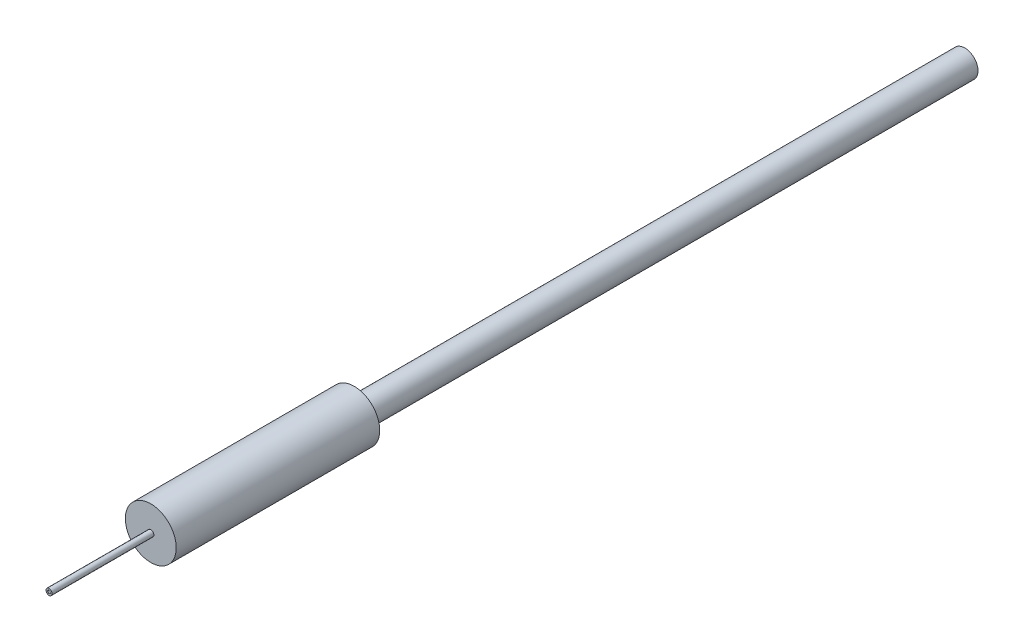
ISO-10303-21;
HEADER;
FILE_DESCRIPTION(('STEP AP214'),'2;1');
FILE_NAME('part.step','',(''),(''),'','','');
FILE_SCHEMA(('AUTOMOTIVE_DESIGN { 1 0 10303 214 1 1 1 1 }'));
ENDSEC;
DATA;
#1=APPLICATION_CONTEXT('core data for automotive mechanical design processes');
#2=APPLICATION_PROTOCOL_DEFINITION('international standard','automotive_design',2000,#1);
#3=PRODUCT_CONTEXT('',#1,'mechanical');
#4=PRODUCT('Part','Part','',(#3));
#5=PRODUCT_RELATED_PRODUCT_CATEGORY('part','',(#4));
#6=PRODUCT_DEFINITION_FORMATION('','',#4);
#7=PRODUCT_DEFINITION_CONTEXT('part definition',#1,'design');
#8=PRODUCT_DEFINITION('design','',#6,#7);
#9=PRODUCT_DEFINITION_SHAPE('','',#8);
#10=(LENGTH_UNIT() NAMED_UNIT(*) SI_UNIT(.MILLI.,.METRE.));
#11=(NAMED_UNIT(*) PLANE_ANGLE_UNIT() SI_UNIT($,.RADIAN.));
#12=(NAMED_UNIT(*) SI_UNIT($,.STERADIAN.) SOLID_ANGLE_UNIT());
#13=UNCERTAINTY_MEASURE_WITH_UNIT(LENGTH_MEASURE(1.E-05),#10,'distance_accuracy_value','');
#14=(GEOMETRIC_REPRESENTATION_CONTEXT(3) GLOBAL_UNCERTAINTY_ASSIGNED_CONTEXT((#13)) GLOBAL_UNIT_ASSIGNED_CONTEXT((#10,
#11,#12)) REPRESENTATION_CONTEXT('',''));
#15=CARTESIAN_POINT('',(0.,0.,0.));
#16=DIRECTION('',(0.,0.,1.));
#17=DIRECTION('',(1.,0.,0.));
#18=AXIS2_PLACEMENT_3D('',#15,#16,#17);
#19=CARTESIAN_POINT('',(0.,0.,-10.));
#20=DIRECTION('',(0.,0.,1.));
#21=DIRECTION('',(1.,0.,0.));
#22=AXIS2_PLACEMENT_3D('',#19,#20,#21);
#23=CYLINDRICAL_SURFACE('',#22,1.25);
#24=CARTESIAN_POINT('',(0.,0.,-10.));
#25=DIRECTION('',(0.,0.,1.));
#26=DIRECTION('',(1.,0.,0.));
#27=AXIS2_PLACEMENT_3D('',#24,#25,#26);
#28=CIRCLE('',#27,1.25);
#29=CARTESIAN_POINT('',(1.25,0.,-10.));
#30=VERTEX_POINT('',#29);
#31=EDGE_CURVE('E41',#30,#30,#28,.T.);
#32=ORIENTED_EDGE('',*,*,#31,.T.);
#33=EDGE_LOOP('',(#32));
#34=FACE_BOUND('',#33,.T.);
#35=CARTESIAN_POINT('',(0.,0.,0.));
#36=DIRECTION('',(0.,0.,1.));
#37=DIRECTION('',(1.,0.,0.));
#38=AXIS2_PLACEMENT_3D('',#35,#36,#37);
#39=CIRCLE('',#38,1.25);
#40=CARTESIAN_POINT('',(1.25,0.,0.));
#41=VERTEX_POINT('',#40);
#42=EDGE_CURVE('E37',#41,#41,#39,.T.);
#43=ORIENTED_EDGE('',*,*,#42,.F.);
#44=EDGE_LOOP('',(#43));
#45=FACE_BOUND('',#44,.T.);
#46=ADVANCED_FACE('F34',(#34,#45),#23,.T.);
#47=CARTESIAN_POINT('',(0.,0.,-10.));
#48=DIRECTION('',(0.,0.,1.));
#49=DIRECTION('',(1.,0.,0.));
#50=AXIS2_PLACEMENT_3D('',#47,#48,#49);
#51=PLANE('',#50);
#52=CARTESIAN_POINT('',(0.,0.,-10.));
#53=DIRECTION('',(0.,0.,-1.));
#54=DIRECTION('',(-1.,0.,0.));
#55=AXIS2_PLACEMENT_3D('',#52,#53,#54);
#56=CIRCLE('',#55,0.65);
#57=CARTESIAN_POINT('',(-0.65,0.,-10.));
#58=VERTEX_POINT('',#57);
#59=EDGE_CURVE('E10',#58,#58,#56,.T.);
#60=ORIENTED_EDGE('',*,*,#59,.F.);
#61=EDGE_LOOP('',(#60));
#62=FACE_BOUND('',#61,.T.);
#63=ORIENTED_EDGE('',*,*,#31,.F.);
#64=EDGE_LOOP('',(#63));
#65=FACE_BOUND('',#64,.T.);
#66=ADVANCED_FACE('F92',(#62,#65),#51,.F.);
#67=CARTESIAN_POINT('',(0.,0.,0.));
#68=DIRECTION('',(0.,0.,1.));
#69=DIRECTION('',(1.,0.,0.));
#70=AXIS2_PLACEMENT_3D('',#67,#68,#69);
#71=PLANE('',#70);
#72=CARTESIAN_POINT('',(0.,0.,0.));
#73=DIRECTION('',(0.,0.,1.));
#74=DIRECTION('',(1.,0.,0.));
#75=AXIS2_PLACEMENT_3D('',#72,#73,#74);
#76=CIRCLE('',#75,0.15);
#77=CARTESIAN_POINT('',(0.15,0.,0.));
#78=VERTEX_POINT('',#77);
#79=EDGE_CURVE('E53',#78,#78,#76,.T.);
#80=ORIENTED_EDGE('',*,*,#79,.F.);
#81=EDGE_LOOP('',(#80));
#82=FACE_BOUND('',#81,.T.);
#83=ORIENTED_EDGE('',*,*,#42,.T.);
#84=EDGE_LOOP('',(#83));
#85=FACE_BOUND('',#84,.T.);
#86=ADVANCED_FACE('F97',(#82,#85),#71,.T.);
#87=CARTESIAN_POINT('',(0.,0.,5.));
#88=DIRECTION('',(0.,0.,-1.));
#89=DIRECTION('',(-1.,0.,0.));
#90=AXIS2_PLACEMENT_3D('',#87,#88,#89);
#91=CYLINDRICAL_SURFACE('',#90,0.15);
#92=CARTESIAN_POINT('',(0.,0.,5.));
#93=DIRECTION('',(0.,0.,1.));
#94=DIRECTION('',(1.,0.,0.));
#95=AXIS2_PLACEMENT_3D('',#92,#93,#94);
#96=CIRCLE('',#95,0.15);
#97=CARTESIAN_POINT('',(0.15,0.,5.));
#98=VERTEX_POINT('',#97);
#99=EDGE_CURVE('E50',#98,#98,#96,.T.);
#100=ORIENTED_EDGE('',*,*,#99,.F.);
#101=EDGE_LOOP('',(#100));
#102=FACE_BOUND('',#101,.T.);
#103=ORIENTED_EDGE('',*,*,#79,.T.);
#104=EDGE_LOOP('',(#103));
#105=FACE_BOUND('',#104,.T.);
#106=ADVANCED_FACE('F106',(#102,#105),#91,.T.);
#107=CARTESIAN_POINT('',(0.,0.,5.));
#108=DIRECTION('',(0.,0.,1.));
#109=DIRECTION('',(1.,0.,0.));
#110=AXIS2_PLACEMENT_3D('',#107,#108,#109);
#111=PLANE('',#110);
#112=CARTESIAN_POINT('',(0.,0.,5.));
#113=DIRECTION('',(0.,0.,1.));
#114=DIRECTION('',(1.,0.,0.));
#115=AXIS2_PLACEMENT_3D('',#112,#113,#114);
#116=CIRCLE('',#115,0.0675);
#117=CARTESIAN_POINT('',(0.0675,0.,5.));
#118=VERTEX_POINT('',#117);
#119=EDGE_CURVE('E62',#118,#118,#116,.T.);
#120=ORIENTED_EDGE('',*,*,#119,.F.);
#121=EDGE_LOOP('',(#120));
#122=FACE_BOUND('',#121,.T.);
#123=ORIENTED_EDGE('',*,*,#99,.T.);
#124=EDGE_LOOP('',(#123));
#125=FACE_BOUND('',#124,.T.);
#126=ADVANCED_FACE('F111',(#122,#125),#111,.T.);
#127=CARTESIAN_POINT('',(0.,0.,-40.));
#128=DIRECTION('',(0.,0.,1.));
#129=DIRECTION('',(1.,0.,0.));
#130=AXIS2_PLACEMENT_3D('',#127,#128,#129);
#131=CYLINDRICAL_SURFACE('',#130,0.65);
#132=CARTESIAN_POINT('',(0.,0.,-40.));
#133=DIRECTION('',(0.,0.,-1.));
#134=DIRECTION('',(-1.,0.,0.));
#135=AXIS2_PLACEMENT_3D('',#132,#133,#134);
#136=CIRCLE('',#135,0.65);
#137=CARTESIAN_POINT('',(-0.65,0.,-40.));
#138=VERTEX_POINT('',#137);
#139=EDGE_CURVE('E48',#138,#138,#136,.T.);
#140=ORIENTED_EDGE('',*,*,#139,.F.);
#141=EDGE_LOOP('',(#140));
#142=FACE_BOUND('',#141,.T.);
#143=ORIENTED_EDGE('',*,*,#59,.T.);
#144=EDGE_LOOP('',(#143));
#145=FACE_BOUND('',#144,.T.);
#146=ADVANCED_FACE('F117',(#142,#145),#131,.T.);
#147=CARTESIAN_POINT('',(0.,0.,-40.));
#148=DIRECTION('',(0.,0.,-1.));
#149=DIRECTION('',(-1.,0.,0.));
#150=AXIS2_PLACEMENT_3D('',#147,#148,#149);
#151=PLANE('',#150);
#152=ORIENTED_EDGE('',*,*,#139,.T.);
#153=EDGE_LOOP('',(#152));
#154=FACE_BOUND('',#153,.T.);
#155=ADVANCED_FACE('F88',(#154),#151,.T.);
#156=CARTESIAN_POINT('',(0.,0.,4.9));
#157=DIRECTION('',(0.,0.,1.));
#158=DIRECTION('',(1.,0.,0.));
#159=AXIS2_PLACEMENT_3D('',#156,#157,#158);
#160=CYLINDRICAL_SURFACE('',#159,0.0675);
#161=CARTESIAN_POINT('',(0.,0.,4.9));
#162=DIRECTION('',(0.,0.,1.));
#163=DIRECTION('',(1.,0.,0.));
#164=AXIS2_PLACEMENT_3D('',#161,#162,#163);
#165=CIRCLE('',#164,0.0675);
#166=CARTESIAN_POINT('',(0.0675,0.,4.9));
#167=VERTEX_POINT('',#166);
#168=EDGE_CURVE('E58',#167,#167,#165,.T.);
#169=ORIENTED_EDGE('',*,*,#168,.F.);
#170=EDGE_LOOP('',(#169));
#171=FACE_BOUND('',#170,.T.);
#172=ORIENTED_EDGE('',*,*,#119,.T.);
#173=EDGE_LOOP('',(#172));
#174=FACE_BOUND('',#173,.T.);
#175=ADVANCED_FACE('F80',(#171,#174),#160,.F.);
#176=CARTESIAN_POINT('',(0.,0.,4.9));
#177=DIRECTION('',(0.,0.,1.));
#178=DIRECTION('',(1.,0.,0.));
#179=AXIS2_PLACEMENT_3D('',#176,#177,#178);
#180=PLANE('',#179);
#181=CARTESIAN_POINT('',(0.,0.,4.9));
#182=DIRECTION('',(0.,0.,1.));
#183=DIRECTION('',(1.,0.,0.));
#184=AXIS2_PLACEMENT_3D('',#181,#182,#183);
#185=CIRCLE('',#184,0.0625);
#186=CARTESIAN_POINT('',(0.0625,0.,4.9));
#187=VERTEX_POINT('',#186);
#188=EDGE_CURVE('E67',#187,#187,#185,.T.);
#189=ORIENTED_EDGE('',*,*,#188,.F.);
#190=EDGE_LOOP('',(#189));
#191=FACE_BOUND('',#190,.T.);
#192=ORIENTED_EDGE('',*,*,#168,.T.);
#193=EDGE_LOOP('',(#192));
#194=FACE_BOUND('',#193,.T.);
#195=ADVANCED_FACE('F78',(#191,#194),#180,.T.);
#196=CARTESIAN_POINT('',(0.,0.,4.9));
#197=DIRECTION('',(0.,0.,1.));
#198=DIRECTION('',(1.,0.,0.));
#199=AXIS2_PLACEMENT_3D('',#196,#197,#198);
#200=CYLINDRICAL_SURFACE('',#199,0.0625);
#201=ORIENTED_EDGE('',*,*,#188,.T.);
#202=EDGE_LOOP('',(#201));
#203=FACE_BOUND('',#202,.T.);
#204=CARTESIAN_POINT('',(0.,0.,5.));
#205=DIRECTION('',(0.,0.,1.));
#206=DIRECTION('',(1.,0.,0.));
#207=AXIS2_PLACEMENT_3D('',#204,#205,#206);
#208=CIRCLE('',#207,0.0625);
#209=CARTESIAN_POINT('',(0.0625,0.,5.));
#210=VERTEX_POINT('',#209);
#211=EDGE_CURVE('E69',#210,#210,#208,.T.);
#212=ORIENTED_EDGE('',*,*,#211,.F.);
#213=EDGE_LOOP('',(#212));
#214=FACE_BOUND('',#213,.T.);
#215=ADVANCED_FACE('F75',(#203,#214),#200,.T.);
#216=ORIENTED_EDGE('',*,*,#211,.T.);
#217=EDGE_LOOP('',(#216));
#218=FACE_BOUND('',#217,.T.);
#219=ADVANCED_FACE('F86',(#218),#111,.T.);
#220=CLOSED_SHELL('',(#46,#66,#86,#106,#126,#146,#155,#175,#195,#215,#219));
#221=MANIFOLD_SOLID_BREP('B2',#220);
#222=ADVANCED_BREP_SHAPE_REPRESENTATION('',(#18,#221),#14);
#223=SHAPE_DEFINITION_REPRESENTATION(#9,#222);
ENDSEC;
END-ISO-10303-21;
